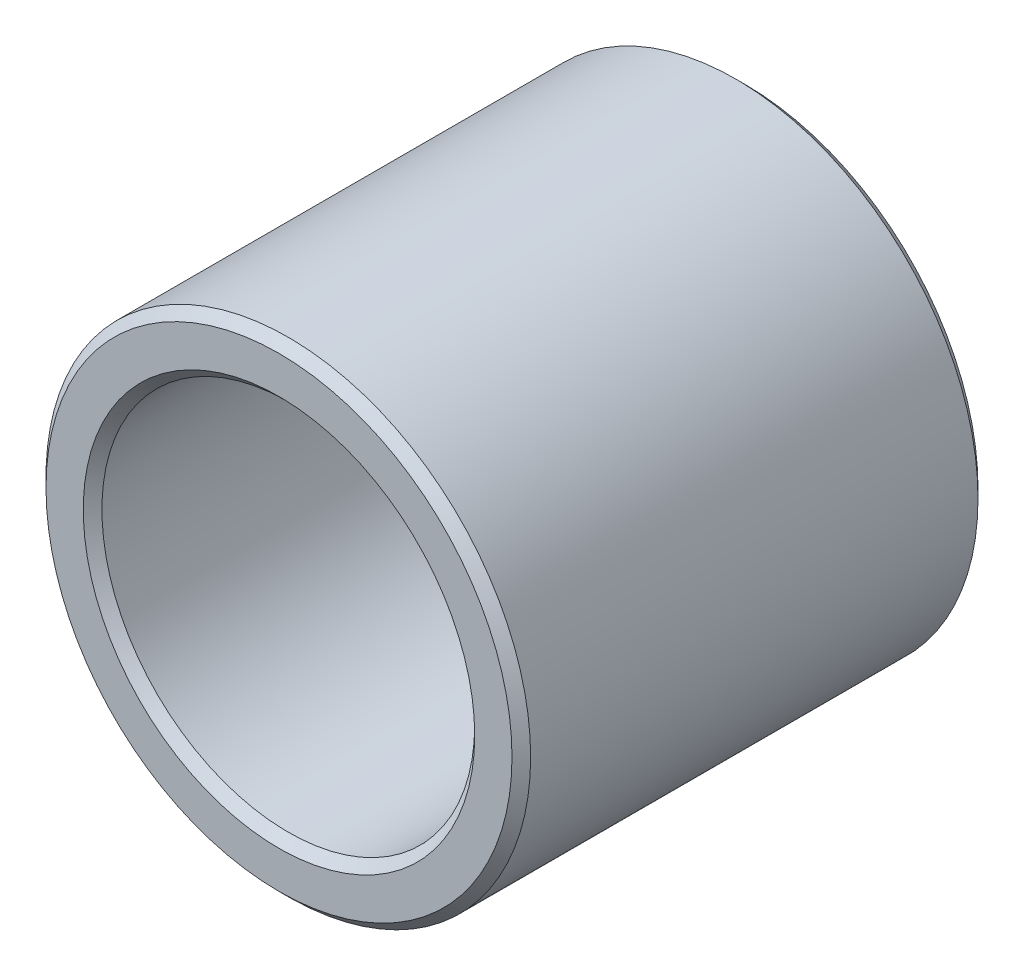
ISO-10303-21;
HEADER;
FILE_DESCRIPTION(('STEP AP214'),'2;1');
FILE_NAME('part.step','',(''),(''),'','','');
FILE_SCHEMA(('AUTOMOTIVE_DESIGN { 1 0 10303 214 1 1 1 1 }'));
ENDSEC;
DATA;
#1=APPLICATION_CONTEXT('core data for automotive mechanical design processes');
#2=APPLICATION_PROTOCOL_DEFINITION('international standard','automotive_design',2000,#1);
#3=PRODUCT_CONTEXT('',#1,'mechanical');
#4=PRODUCT('Part','Part','',(#3));
#5=PRODUCT_RELATED_PRODUCT_CATEGORY('part','',(#4));
#6=PRODUCT_DEFINITION_FORMATION('','',#4);
#7=PRODUCT_DEFINITION_CONTEXT('part definition',#1,'design');
#8=PRODUCT_DEFINITION('design','',#6,#7);
#9=PRODUCT_DEFINITION_SHAPE('','',#8);
#10=(LENGTH_UNIT() NAMED_UNIT(*) SI_UNIT(.MILLI.,.METRE.));
#11=(NAMED_UNIT(*) PLANE_ANGLE_UNIT() SI_UNIT($,.RADIAN.));
#12=(NAMED_UNIT(*) SI_UNIT($,.STERADIAN.) SOLID_ANGLE_UNIT());
#13=UNCERTAINTY_MEASURE_WITH_UNIT(LENGTH_MEASURE(1.E-05),#10,'distance_accuracy_value','');
#14=(GEOMETRIC_REPRESENTATION_CONTEXT(3) GLOBAL_UNCERTAINTY_ASSIGNED_CONTEXT((#13)) GLOBAL_UNIT_ASSIGNED_CONTEXT((#10,
#11,#12)) REPRESENTATION_CONTEXT('',''));
#15=CARTESIAN_POINT('',(0.,0.,0.));
#16=DIRECTION('',(0.,0.,1.));
#17=DIRECTION('',(1.,0.,0.));
#18=AXIS2_PLACEMENT_3D('',#15,#16,#17);
#19=CARTESIAN_POINT('',(0.,0.,-25.));
#20=DIRECTION('',(0.,0.,1.));
#21=DIRECTION('',(1.,0.,0.));
#22=AXIS2_PLACEMENT_3D('',#19,#20,#21);
#23=CYLINDRICAL_SURFACE('',#22,13.);
#24=CARTESIAN_POINT('',(0.,0.,-0.5));
#25=DIRECTION('',(0.,0.,1.));
#26=DIRECTION('',(1.,0.,0.));
#27=AXIS2_PLACEMENT_3D('',#24,#25,#26);
#28=CIRCLE('',#27,13.);
#29=CARTESIAN_POINT('',(13.,0.,-0.499999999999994));
#30=VERTEX_POINT('',#29);
#31=EDGE_CURVE('E41',#30,#30,#28,.F.);
#32=ORIENTED_EDGE('',*,*,#31,.T.);
#33=EDGE_LOOP('',(#32));
#34=FACE_BOUND('',#33,.T.);
#35=CARTESIAN_POINT('',(0.,0.,-24.5));
#36=DIRECTION('',(0.,0.,1.));
#37=DIRECTION('',(1.,0.,0.));
#38=AXIS2_PLACEMENT_3D('',#35,#36,#37);
#39=CIRCLE('',#38,13.);
#40=CARTESIAN_POINT('',(13.0000000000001,0.,-24.5));
#41=VERTEX_POINT('',#40);
#42=EDGE_CURVE('E44',#41,#41,#39,.T.);
#43=ORIENTED_EDGE('',*,*,#42,.T.);
#44=EDGE_LOOP('',(#43));
#45=FACE_BOUND('',#44,.T.);
#46=ADVANCED_FACE('F22',(#34,#45),#23,.T.);
#47=CARTESIAN_POINT('',(0.,0.,-25.));
#48=DIRECTION('',(0.,0.,1.));
#49=DIRECTION('',(1.,0.,0.));
#50=AXIS2_PLACEMENT_3D('',#47,#48,#49);
#51=PLANE('',#50);
#52=CARTESIAN_POINT('',(0.,0.,-25.));
#53=DIRECTION('',(0.,0.,1.));
#54=DIRECTION('',(1.,0.,0.));
#55=AXIS2_PLACEMENT_3D('',#52,#53,#54);
#56=CIRCLE('',#55,12.5);
#57=CARTESIAN_POINT('',(12.5000000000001,0.,-24.9999999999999));
#58=VERTEX_POINT('',#57);
#59=EDGE_CURVE('E10',#58,#58,#56,.F.);
#60=ORIENTED_EDGE('',*,*,#59,.T.);
#61=EDGE_LOOP('',(#60));
#62=FACE_BOUND('',#61,.T.);
#63=CARTESIAN_POINT('',(0.,0.,-25.));
#64=DIRECTION('',(0.,0.,1.));
#65=DIRECTION('',(1.,0.,0.));
#66=AXIS2_PLACEMENT_3D('',#63,#64,#65);
#67=CIRCLE('',#66,10.5);
#68=CARTESIAN_POINT('',(10.5000000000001,0.,-25.));
#69=VERTEX_POINT('',#68);
#70=EDGE_CURVE('E28',#69,#69,#67,.T.);
#71=ORIENTED_EDGE('',*,*,#70,.T.);
#72=EDGE_LOOP('',(#71));
#73=FACE_BOUND('',#72,.T.);
#74=ADVANCED_FACE('F80',(#62,#73),#51,.F.);
#75=CARTESIAN_POINT('',(0.,0.,0.));
#76=DIRECTION('',(0.,0.,1.));
#77=DIRECTION('',(1.,0.,0.));
#78=AXIS2_PLACEMENT_3D('',#75,#76,#77);
#79=PLANE('',#78);
#80=CARTESIAN_POINT('',(0.,0.,0.));
#81=DIRECTION('',(0.,0.,1.));
#82=DIRECTION('',(1.,0.,0.));
#83=AXIS2_PLACEMENT_3D('',#80,#81,#82);
#84=CIRCLE('',#83,12.5);
#85=CARTESIAN_POINT('',(12.5,0.,0.));
#86=VERTEX_POINT('',#85);
#87=EDGE_CURVE('E47',#86,#86,#84,.T.);
#88=ORIENTED_EDGE('',*,*,#87,.T.);
#89=EDGE_LOOP('',(#88));
#90=FACE_BOUND('',#89,.T.);
#91=CARTESIAN_POINT('',(0.,0.,0.));
#92=DIRECTION('',(0.,0.,1.));
#93=DIRECTION('',(1.,0.,0.));
#94=AXIS2_PLACEMENT_3D('',#91,#92,#93);
#95=CIRCLE('',#94,10.5);
#96=CARTESIAN_POINT('',(10.5,0.,0.));
#97=VERTEX_POINT('',#96);
#98=EDGE_CURVE('E50',#97,#97,#95,.F.);
#99=ORIENTED_EDGE('',*,*,#98,.T.);
#100=EDGE_LOOP('',(#99));
#101=FACE_BOUND('',#100,.T.);
#102=ADVANCED_FACE('F54',(#90,#101),#79,.T.);
#103=CARTESIAN_POINT('',(0.,0.,-25.));
#104=DIRECTION('',(0.,0.,1.));
#105=DIRECTION('',(1.,0.,0.));
#106=AXIS2_PLACEMENT_3D('',#103,#104,#105);
#107=CYLINDRICAL_SURFACE('',#106,10.);
#108=CARTESIAN_POINT('',(0.,0.,-0.5));
#109=DIRECTION('',(0.,0.,1.));
#110=DIRECTION('',(1.,0.,0.));
#111=AXIS2_PLACEMENT_3D('',#108,#109,#110);
#112=CIRCLE('',#111,10.);
#113=CARTESIAN_POINT('',(10.,0.,-0.499999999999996));
#114=VERTEX_POINT('',#113);
#115=EDGE_CURVE('E32',#114,#114,#112,.T.);
#116=ORIENTED_EDGE('',*,*,#115,.T.);
#117=EDGE_LOOP('',(#116));
#118=FACE_BOUND('',#117,.T.);
#119=CARTESIAN_POINT('',(0.,0.,-24.5));
#120=DIRECTION('',(0.,0.,1.));
#121=DIRECTION('',(1.,0.,0.));
#122=AXIS2_PLACEMENT_3D('',#119,#120,#121);
#123=CIRCLE('',#122,10.);
#124=CARTESIAN_POINT('',(10.0000000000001,0.,-24.5));
#125=VERTEX_POINT('',#124);
#126=EDGE_CURVE('E36',#125,#125,#123,.F.);
#127=ORIENTED_EDGE('',*,*,#126,.T.);
#128=EDGE_LOOP('',(#127));
#129=FACE_BOUND('',#128,.T.);
#130=ADVANCED_FACE('F64',(#118,#129),#107,.F.);
#131=CARTESIAN_POINT('',(0.,0.,0.));
#132=DIRECTION('',(0.,0.,-1.));
#133=DIRECTION('',(-1.,0.,0.));
#134=AXIS2_PLACEMENT_3D('',#131,#132,#133);
#135=CONICAL_SURFACE('',#134,12.5,0.785398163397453);
#136=ORIENTED_EDGE('',*,*,#31,.F.);
#137=EDGE_LOOP('',(#136));
#138=FACE_BOUND('',#137,.T.);
#139=ORIENTED_EDGE('',*,*,#87,.F.);
#140=EDGE_LOOP('',(#139));
#141=FACE_BOUND('',#140,.T.);
#142=ADVANCED_FACE('F60',(#138,#141),#135,.T.);
#143=CARTESIAN_POINT('',(0.,0.,-0.5));
#144=DIRECTION('',(0.,0.,1.));
#145=DIRECTION('',(1.,0.,0.));
#146=AXIS2_PLACEMENT_3D('',#143,#144,#145);
#147=CONICAL_SURFACE('',#146,10.,0.785398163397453);
#148=ORIENTED_EDGE('',*,*,#98,.F.);
#149=EDGE_LOOP('',(#148));
#150=FACE_BOUND('',#149,.T.);
#151=ORIENTED_EDGE('',*,*,#115,.F.);
#152=EDGE_LOOP('',(#151));
#153=FACE_BOUND('',#152,.T.);
#154=ADVANCED_FACE('F56',(#150,#153),#147,.F.);
#155=CARTESIAN_POINT('',(0.,0.,-24.5));
#156=DIRECTION('',(0.,0.,1.));
#157=DIRECTION('',(1.,0.,0.));
#158=AXIS2_PLACEMENT_3D('',#155,#156,#157);
#159=CONICAL_SURFACE('',#158,13.,0.785398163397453);
#160=ORIENTED_EDGE('',*,*,#59,.F.);
#161=EDGE_LOOP('',(#160));
#162=FACE_BOUND('',#161,.T.);
#163=ORIENTED_EDGE('',*,*,#42,.F.);
#164=EDGE_LOOP('',(#163));
#165=FACE_BOUND('',#164,.T.);
#166=ADVANCED_FACE('F59',(#162,#165),#159,.T.);
#167=CARTESIAN_POINT('',(0.,0.,-25.));
#168=DIRECTION('',(0.,0.,-1.));
#169=DIRECTION('',(-1.,0.,0.));
#170=AXIS2_PLACEMENT_3D('',#167,#168,#169);
#171=CONICAL_SURFACE('',#170,10.5,0.785398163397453);
#172=ORIENTED_EDGE('',*,*,#126,.F.);
#173=EDGE_LOOP('',(#172));
#174=FACE_BOUND('',#173,.T.);
#175=ORIENTED_EDGE('',*,*,#70,.F.);
#176=EDGE_LOOP('',(#175));
#177=FACE_BOUND('',#176,.T.);
#178=ADVANCED_FACE('F70',(#174,#177),#171,.F.);
#179=CLOSED_SHELL('',(#46,#74,#102,#130,#142,#154,#166,#178));
#180=MANIFOLD_SOLID_BREP('B2',#179);
#181=ADVANCED_BREP_SHAPE_REPRESENTATION('',(#18,#180),#14);
#182=SHAPE_DEFINITION_REPRESENTATION(#9,#181);
ENDSEC;
END-ISO-10303-21;
